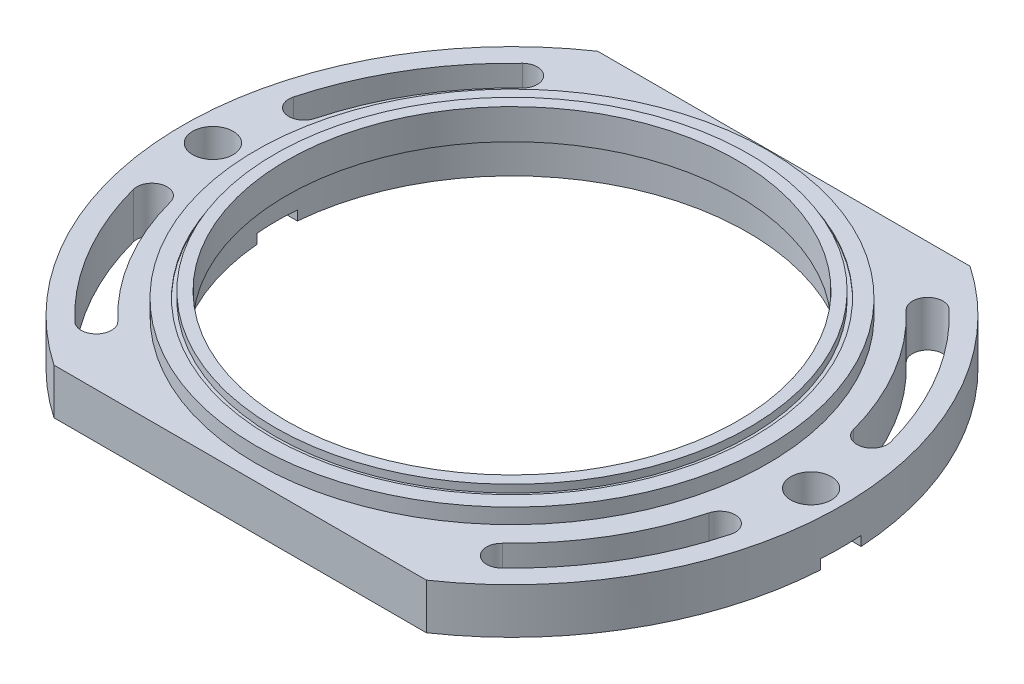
ISO-10303-21;
HEADER;
FILE_DESCRIPTION(('STEP AP214'),'2;1');
FILE_NAME('part.step','',(''),(''),'','','');
FILE_SCHEMA(('AUTOMOTIVE_DESIGN { 1 0 10303 214 1 1 1 1 }'));
ENDSEC;
DATA;
#1=APPLICATION_CONTEXT('core data for automotive mechanical design processes');
#2=APPLICATION_PROTOCOL_DEFINITION('international standard','automotive_design',2000,#1);
#3=PRODUCT_CONTEXT('',#1,'mechanical');
#4=PRODUCT('Part','Part','',(#3));
#5=PRODUCT_RELATED_PRODUCT_CATEGORY('part','',(#4));
#6=PRODUCT_DEFINITION_FORMATION('','',#4);
#7=PRODUCT_DEFINITION_CONTEXT('part definition',#1,'design');
#8=PRODUCT_DEFINITION('design','',#6,#7);
#9=PRODUCT_DEFINITION_SHAPE('','',#8);
#10=(LENGTH_UNIT() NAMED_UNIT(*) SI_UNIT(.MILLI.,.METRE.));
#11=(NAMED_UNIT(*) PLANE_ANGLE_UNIT() SI_UNIT($,.RADIAN.));
#12=(NAMED_UNIT(*) SI_UNIT($,.STERADIAN.) SOLID_ANGLE_UNIT());
#13=UNCERTAINTY_MEASURE_WITH_UNIT(LENGTH_MEASURE(1.E-05),#10,'distance_accuracy_value','');
#14=(GEOMETRIC_REPRESENTATION_CONTEXT(3) GLOBAL_UNCERTAINTY_ASSIGNED_CONTEXT((#13)) GLOBAL_UNIT_ASSIGNED_CONTEXT((#10,
#11,#12)) REPRESENTATION_CONTEXT('',''));
#15=CARTESIAN_POINT('',(0.,0.,0.));
#16=DIRECTION('',(0.,0.,1.));
#17=DIRECTION('',(1.,0.,0.));
#18=AXIS2_PLACEMENT_3D('',#15,#16,#17);
#19=CARTESIAN_POINT('',(-140.,3.8,8.));
#20=DIRECTION('',(0.,1.,0.));
#21=DIRECTION('',(0.,0.,1.));
#22=AXIS2_PLACEMENT_3D('',#19,#20,#21);
#23=PLANE('',#22);
#24=CARTESIAN_POINT('',(-101.,3.79999999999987,0.));
#25=DIRECTION('',(0.,-1.,0.));
#26=DIRECTION('',(0.,0.,-1.));
#27=AXIS2_PLACEMENT_3D('',#24,#25,#26);
#28=CIRCLE('',#27,4.);
#29=CARTESIAN_POINT('',(-101.,3.79999999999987,-3.99999999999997));
#30=VERTEX_POINT('',#29);
#31=EDGE_CURVE('E573',#30,#30,#28,.T.);
#32=ORIENTED_EDGE('',*,*,#31,.F.);
#33=EDGE_LOOP('',(#32));
#34=FACE_BOUND('',#33,.T.);
#35=CARTESIAN_POINT('',(-118.,3.8,0.));
#36=DIRECTION('',(0.,-1.,0.));
#37=DIRECTION('',(0.,0.,-1.));
#38=AXIS2_PLACEMENT_3D('',#35,#36,#37);
#39=CIRCLE('',#38,7.99999999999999);
#40=CARTESIAN_POINT('',(-118.,3.8,-8.));
#41=VERTEX_POINT('',#40);
#42=CARTESIAN_POINT('',(-118.,3.8,8.));
#43=VERTEX_POINT('',#42);
#44=EDGE_CURVE('E370',#41,#43,#39,.T.);
#45=ORIENTED_EDGE('',*,*,#44,.F.);
#46=DIRECTION('',(1.,0.,0.));
#47=VECTOR('',#46,1.);
#48=CARTESIAN_POINT('',(-140.,3.8,-8.));
#49=LINE('',#48,#47);
#50=CARTESIAN_POINT('',(-92.655275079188,3.8,-8.));
#51=VERTEX_POINT('',#50);
#52=EDGE_CURVE('E602',#41,#51,#49,.T.);
#53=ORIENTED_EDGE('',*,*,#52,.T.);
#54=CARTESIAN_POINT('',(0.,3.8,0.));
#55=DIRECTION('',(0.,1.,0.));
#56=DIRECTION('',(0.,0.,1.));
#57=AXIS2_PLACEMENT_3D('',#54,#55,#56);
#58=CIRCLE('',#57,93.);
#59=CARTESIAN_POINT('',(-92.655275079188,3.8,8.));
#60=VERTEX_POINT('',#59);
#61=EDGE_CURVE('E364',#51,#60,#58,.T.);
#62=ORIENTED_EDGE('',*,*,#61,.T.);
#63=DIRECTION('',(1.,0.,0.));
#64=VECTOR('',#63,1.);
#65=CARTESIAN_POINT('',(-140.,3.8,8.));
#66=LINE('',#65,#64);
#67=EDGE_CURVE('E596',#43,#60,#66,.T.);
#68=ORIENTED_EDGE('',*,*,#67,.F.);
#69=EDGE_LOOP('',(#45,#53,#62,#68));
#70=FACE_BOUND('',#69,.T.);
#71=ADVANCED_FACE('F356',(#34,#70),#23,.F.);
#72=EDGE_CURVE('E582',#43,#41,#39,.T.);
#73=ORIENTED_EDGE('',*,*,#72,.F.);
#74=CARTESIAN_POINT('',(-129.753612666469,3.8,8.));
#75=VERTEX_POINT('',#74);
#76=EDGE_CURVE('E598',#75,#43,#66,.T.);
#77=ORIENTED_EDGE('',*,*,#76,.F.);
#78=CARTESIAN_POINT('',(0.,3.8,0.));
#79=DIRECTION('',(0.,1.,0.));
#80=DIRECTION('',(0.,0.,1.));
#81=AXIS2_PLACEMENT_3D('',#78,#79,#80);
#82=CIRCLE('',#81,130.);
#83=CARTESIAN_POINT('',(-129.753612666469,3.8,-8.));
#84=VERTEX_POINT('',#83);
#85=EDGE_CURVE('E615',#75,#84,#82,.F.);
#86=ORIENTED_EDGE('',*,*,#85,.T.);
#87=EDGE_CURVE('E603',#84,#41,#49,.T.);
#88=ORIENTED_EDGE('',*,*,#87,.T.);
#89=EDGE_LOOP('',(#73,#77,#86,#88));
#90=FACE_BOUND('',#89,.T.);
#91=ADVANCED_FACE('F920',(#90),#23,.F.);
#92=CARTESIAN_POINT('',(118.,3.8,0.));
#93=DIRECTION('',(0.,-1.,0.));
#94=DIRECTION('',(0.,0.,-1.));
#95=AXIS2_PLACEMENT_3D('',#92,#93,#94);
#96=CIRCLE('',#95,7.99999999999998);
#97=CARTESIAN_POINT('',(118.,3.8,-8.));
#98=VERTEX_POINT('',#97);
#99=CARTESIAN_POINT('',(118.,3.8,8.));
#100=VERTEX_POINT('',#99);
#101=EDGE_CURVE('E377',#98,#100,#96,.T.);
#102=ORIENTED_EDGE('',*,*,#101,.F.);
#103=CARTESIAN_POINT('',(129.753612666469,3.8,-8.));
#104=VERTEX_POINT('',#103);
#105=EDGE_CURVE('E592',#98,#104,#49,.T.);
#106=ORIENTED_EDGE('',*,*,#105,.T.);
#107=CARTESIAN_POINT('',(0.,3.8,0.));
#108=DIRECTION('',(0.,1.,0.));
#109=DIRECTION('',(0.,0.,1.));
#110=AXIS2_PLACEMENT_3D('',#107,#108,#109);
#111=CIRCLE('',#110,130.);
#112=CARTESIAN_POINT('',(129.753612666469,3.8,8.));
#113=VERTEX_POINT('',#112);
#114=EDGE_CURVE('E612',#104,#113,#111,.F.);
#115=ORIENTED_EDGE('',*,*,#114,.T.);
#116=EDGE_CURVE('E597',#100,#113,#66,.T.);
#117=ORIENTED_EDGE('',*,*,#116,.F.);
#118=EDGE_LOOP('',(#102,#106,#115,#117));
#119=FACE_BOUND('',#118,.T.);
#120=ADVANCED_FACE('F900',(#119),#23,.F.);
#121=CARTESIAN_POINT('',(101.,3.79999999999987,0.));
#122=DIRECTION('',(0.,-1.,0.));
#123=DIRECTION('',(0.,0.,-1.));
#124=AXIS2_PLACEMENT_3D('',#121,#122,#123);
#125=CIRCLE('',#124,4.);
#126=CARTESIAN_POINT('',(101.,3.79999999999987,-4.));
#127=VERTEX_POINT('',#126);
#128=EDGE_CURVE('E566',#127,#127,#125,.T.);
#129=ORIENTED_EDGE('',*,*,#128,.F.);
#130=EDGE_LOOP('',(#129));
#131=FACE_BOUND('',#130,.T.);
#132=EDGE_CURVE('E587',#100,#98,#96,.T.);
#133=ORIENTED_EDGE('',*,*,#132,.F.);
#134=CARTESIAN_POINT('',(92.655275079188,3.8,8.));
#135=VERTEX_POINT('',#134);
#136=EDGE_CURVE('E593',#135,#100,#66,.T.);
#137=ORIENTED_EDGE('',*,*,#136,.F.);
#138=CARTESIAN_POINT('',(92.655275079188,3.8,-8.));
#139=VERTEX_POINT('',#138);
#140=EDGE_CURVE('E831',#135,#139,#58,.T.);
#141=ORIENTED_EDGE('',*,*,#140,.T.);
#142=EDGE_CURVE('E599',#139,#98,#49,.T.);
#143=ORIENTED_EDGE('',*,*,#142,.T.);
#144=EDGE_LOOP('',(#133,#137,#141,#143));
#145=FACE_BOUND('',#144,.T.);
#146=ADVANCED_FACE('F897',(#131,#145),#23,.F.);
#147=CARTESIAN_POINT('',(-93.,0.,0.));
#148=DIRECTION('',(0.,-1.,0.));
#149=DIRECTION('',(0.,0.,-1.));
#150=AXIS2_PLACEMENT_3D('',#147,#148,#149);
#151=PLANE('',#150);
#152=DIRECTION('',(-1.,0.,0.));
#153=VECTOR('',#152,1.);
#154=CARTESIAN_POINT('',(-93.,0.,8.));
#155=LINE('',#154,#153);
#156=CARTESIAN_POINT('',(129.753612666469,0.,8.));
#157=VERTEX_POINT('',#156);
#158=CARTESIAN_POINT('',(92.655275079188,0.,8.));
#159=VERTEX_POINT('',#158);
#160=EDGE_CURVE('E620',#157,#159,#155,.T.);
#161=ORIENTED_EDGE('',*,*,#160,.F.);
#162=CARTESIAN_POINT('',(0.,0.,0.));
#163=DIRECTION('',(0.,1.,0.));
#164=DIRECTION('',(0.,0.,1.));
#165=AXIS2_PLACEMENT_3D('',#162,#163,#164);
#166=CIRCLE('',#165,130.);
#167=CARTESIAN_POINT('',(73.4672546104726,0.,107.25));
#168=VERTEX_POINT('',#167);
#169=EDGE_CURVE('E741',#168,#157,#166,.T.);
#170=ORIENTED_EDGE('',*,*,#169,.F.);
#171=DIRECTION('',(-1.,0.,0.));
#172=VECTOR('',#171,1.);
#173=CARTESIAN_POINT('',(-93.,0.,107.25));
#174=LINE('',#173,#172);
#175=CARTESIAN_POINT('',(-73.4672546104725,0.,107.25));
#176=VERTEX_POINT('',#175);
#177=EDGE_CURVE('E775',#168,#176,#174,.T.);
#178=ORIENTED_EDGE('',*,*,#177,.T.);
#179=CARTESIAN_POINT('',(-129.753612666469,0.,8.));
#180=VERTEX_POINT('',#179);
#181=EDGE_CURVE('E746',#180,#176,#166,.T.);
#182=ORIENTED_EDGE('',*,*,#181,.F.);
#183=CARTESIAN_POINT('',(-92.655275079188,0.,8.));
#184=VERTEX_POINT('',#183);
#185=EDGE_CURVE('E617',#184,#180,#155,.T.);
#186=ORIENTED_EDGE('',*,*,#185,.F.);
#187=CARTESIAN_POINT('',(0.,0.,0.));
#188=DIRECTION('',(0.,1.,0.));
#189=DIRECTION('',(0.,0.,1.));
#190=AXIS2_PLACEMENT_3D('',#187,#188,#189);
#191=CIRCLE('',#190,93.);
#192=EDGE_CURVE('E737',#184,#159,#191,.T.);
#193=ORIENTED_EDGE('',*,*,#192,.T.);
#194=EDGE_LOOP('',(#161,#170,#178,#182,#186,#193));
#195=FACE_BOUND('',#194,.T.);
#196=CARTESIAN_POINT('',(80.,0.,84.));
#197=DIRECTION('',(0.,-1.,0.));
#198=DIRECTION('',(0.,0.,-1.));
#199=AXIS2_PLACEMENT_3D('',#196,#197,#198);
#200=CIRCLE('',#199,6.00000000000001);
#201=CARTESIAN_POINT('',(75.8620689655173,0.,79.6551724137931));
#202=VERTEX_POINT('',#201);
#203=CARTESIAN_POINT('',(84.1379310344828,0.,88.3448275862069));
#204=VERTEX_POINT('',#203);
#205=EDGE_CURVE('E817',#202,#204,#200,.F.);
#206=ORIENTED_EDGE('',*,*,#205,.T.);
#207=CARTESIAN_POINT('',(0.,0.,0.));
#208=DIRECTION('',(0.,-1.,0.));
#209=DIRECTION('',(0.,0.,-1.));
#210=AXIS2_PLACEMENT_3D('',#207,#208,#209);
#211=CIRCLE('',#210,122.);
#212=CARTESIAN_POINT('',(117.849432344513,0.,31.551724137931));
#213=VERTEX_POINT('',#212);
#214=EDGE_CURVE('E826',#204,#213,#211,.F.);
#215=ORIENTED_EDGE('',*,*,#214,.T.);
#216=CARTESIAN_POINT('',(112.053558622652,0.,30.));
#217=DIRECTION('',(0.,-1.,0.));
#218=DIRECTION('',(0.,0.,-1.));
#219=AXIS2_PLACEMENT_3D('',#216,#217,#218);
#220=CIRCLE('',#219,6.);
#221=CARTESIAN_POINT('',(106.25768490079,0.,28.448275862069));
#222=VERTEX_POINT('',#221);
#223=EDGE_CURVE('E823',#213,#222,#220,.F.);
#224=ORIENTED_EDGE('',*,*,#223,.T.);
#225=CARTESIAN_POINT('',(0.,0.,0.));
#226=DIRECTION('',(0.,-1.,0.));
#227=DIRECTION('',(0.,0.,-1.));
#228=AXIS2_PLACEMENT_3D('',#225,#226,#227);
#229=CIRCLE('',#228,110.);
#230=EDGE_CURVE('E820',#222,#202,#229,.T.);
#231=ORIENTED_EDGE('',*,*,#230,.T.);
#232=EDGE_LOOP('',(#206,#215,#224,#231));
#233=FACE_BOUND('',#232,.T.);
#234=CARTESIAN_POINT('',(-80.,0.,84.));
#235=DIRECTION('',(0.,-1.,0.));
#236=DIRECTION('',(0.,0.,-1.));
#237=AXIS2_PLACEMENT_3D('',#234,#235,#236);
#238=CIRCLE('',#237,6.00000000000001);
#239=CARTESIAN_POINT('',(-84.1379310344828,0.,88.3448275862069));
#240=VERTEX_POINT('',#239);
#241=CARTESIAN_POINT('',(-75.8620689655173,0.,79.6551724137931));
#242=VERTEX_POINT('',#241);
#243=EDGE_CURVE('E805',#240,#242,#238,.F.);
#244=ORIENTED_EDGE('',*,*,#243,.T.);
#245=CARTESIAN_POINT('',(0.,0.,0.));
#246=DIRECTION('',(0.,-1.,0.));
#247=DIRECTION('',(0.,0.,-1.));
#248=AXIS2_PLACEMENT_3D('',#245,#246,#247);
#249=CIRCLE('',#248,110.);
#250=CARTESIAN_POINT('',(-106.25768490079,0.,28.448275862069));
#251=VERTEX_POINT('',#250);
#252=EDGE_CURVE('E814',#242,#251,#249,.T.);
#253=ORIENTED_EDGE('',*,*,#252,.T.);
#254=CARTESIAN_POINT('',(-112.053558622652,0.,30.));
#255=DIRECTION('',(0.,-1.,0.));
#256=DIRECTION('',(0.,0.,-1.));
#257=AXIS2_PLACEMENT_3D('',#254,#255,#256);
#258=CIRCLE('',#257,6.);
#259=CARTESIAN_POINT('',(-117.849432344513,0.,31.551724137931));
#260=VERTEX_POINT('',#259);
#261=EDGE_CURVE('E811',#251,#260,#258,.F.);
#262=ORIENTED_EDGE('',*,*,#261,.T.);
#263=CARTESIAN_POINT('',(0.,0.,0.));
#264=DIRECTION('',(0.,-1.,0.));
#265=DIRECTION('',(0.,0.,-1.));
#266=AXIS2_PLACEMENT_3D('',#263,#264,#265);
#267=CIRCLE('',#266,122.);
#268=EDGE_CURVE('E808',#260,#240,#267,.F.);
#269=ORIENTED_EDGE('',*,*,#268,.T.);
#270=EDGE_LOOP('',(#244,#253,#262,#269));
#271=FACE_BOUND('',#270,.T.);
#272=ADVANCED_FACE('F858',(#195,#233,#271),#151,.T.);
#273=CARTESIAN_POINT('',(-101.,18.,0.));
#274=DIRECTION('',(0.,1.,0.));
#275=DIRECTION('',(0.,0.,1.));
#276=AXIS2_PLACEMENT_3D('',#273,#274,#275);
#277=PLANE('',#276);
#278=CARTESIAN_POINT('',(-118.,18.,0.));
#279=DIRECTION('',(0.,1.,0.));
#280=DIRECTION('',(0.,0.,1.));
#281=AXIS2_PLACEMENT_3D('',#278,#279,#280);
#282=CIRCLE('',#281,7.99999999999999);
#283=CARTESIAN_POINT('',(-118.,18.,7.99999999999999));
#284=VERTEX_POINT('',#283);
#285=EDGE_CURVE('E584',#284,#284,#282,.T.);
#286=ORIENTED_EDGE('',*,*,#285,.F.);
#287=EDGE_LOOP('',(#286));
#288=FACE_BOUND('',#287,.T.);
#289=CARTESIAN_POINT('',(118.,18.,0.));
#290=DIRECTION('',(0.,1.,0.));
#291=DIRECTION('',(0.,0.,1.));
#292=AXIS2_PLACEMENT_3D('',#289,#290,#291);
#293=CIRCLE('',#292,7.99999999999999);
#294=CARTESIAN_POINT('',(118.,18.,7.99999999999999));
#295=VERTEX_POINT('',#294);
#296=EDGE_CURVE('E589',#295,#295,#293,.T.);
#297=ORIENTED_EDGE('',*,*,#296,.F.);
#298=EDGE_LOOP('',(#297));
#299=FACE_BOUND('',#298,.T.);
#300=CARTESIAN_POINT('',(-112.053558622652,18.,30.));
#301=DIRECTION('',(0.,1.,0.));
#302=DIRECTION('',(0.,0.,1.));
#303=AXIS2_PLACEMENT_3D('',#300,#301,#302);
#304=CIRCLE('',#303,6.);
#305=CARTESIAN_POINT('',(-117.849432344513,18.,31.551724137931));
#306=VERTEX_POINT('',#305);
#307=CARTESIAN_POINT('',(-106.25768490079,18.,28.448275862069));
#308=VERTEX_POINT('',#307);
#309=EDGE_CURVE('E664',#306,#308,#304,.F.);
#310=ORIENTED_EDGE('',*,*,#309,.T.);
#311=CARTESIAN_POINT('',(0.,18.,0.));
#312=DIRECTION('',(0.,1.,0.));
#313=DIRECTION('',(0.,0.,1.));
#314=AXIS2_PLACEMENT_3D('',#311,#312,#313);
#315=CIRCLE('',#314,110.);
#316=CARTESIAN_POINT('',(-75.8620689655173,18.,79.6551724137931));
#317=VERTEX_POINT('',#316);
#318=EDGE_CURVE('E667',#308,#317,#315,.T.);
#319=ORIENTED_EDGE('',*,*,#318,.T.);
#320=CARTESIAN_POINT('',(-80.,18.,84.));
#321=DIRECTION('',(0.,1.,0.));
#322=DIRECTION('',(0.,0.,1.));
#323=AXIS2_PLACEMENT_3D('',#320,#321,#322);
#324=CIRCLE('',#323,6.00000000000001);
#325=CARTESIAN_POINT('',(-84.1379310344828,18.,88.3448275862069));
#326=VERTEX_POINT('',#325);
#327=EDGE_CURVE('E658',#317,#326,#324,.F.);
#328=ORIENTED_EDGE('',*,*,#327,.T.);
#329=CARTESIAN_POINT('',(0.,18.,0.));
#330=DIRECTION('',(0.,1.,0.));
#331=DIRECTION('',(0.,0.,1.));
#332=AXIS2_PLACEMENT_3D('',#329,#330,#331);
#333=CIRCLE('',#332,122.);
#334=EDGE_CURVE('E661',#326,#306,#333,.F.);
#335=ORIENTED_EDGE('',*,*,#334,.T.);
#336=EDGE_LOOP('',(#310,#319,#328,#335));
#337=FACE_BOUND('',#336,.T.);
#338=CARTESIAN_POINT('',(80.,18.,-84.));
#339=DIRECTION('',(0.,1.,0.));
#340=DIRECTION('',(0.,0.,1.));
#341=AXIS2_PLACEMENT_3D('',#338,#339,#340);
#342=CIRCLE('',#341,6.00000000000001);
#343=CARTESIAN_POINT('',(75.8620689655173,18.,-79.6551724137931));
#344=VERTEX_POINT('',#343);
#345=CARTESIAN_POINT('',(84.1379310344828,18.,-88.3448275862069));
#346=VERTEX_POINT('',#345);
#347=EDGE_CURVE('E710',#344,#346,#342,.F.);
#348=ORIENTED_EDGE('',*,*,#347,.T.);
#349=CARTESIAN_POINT('',(0.,18.,0.));
#350=DIRECTION('',(0.,1.,0.));
#351=DIRECTION('',(0.,0.,1.));
#352=AXIS2_PLACEMENT_3D('',#349,#350,#351);
#353=CIRCLE('',#352,122.);
#354=CARTESIAN_POINT('',(117.849432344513,18.,-31.551724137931));
#355=VERTEX_POINT('',#354);
#356=EDGE_CURVE('E713',#346,#355,#353,.F.);
#357=ORIENTED_EDGE('',*,*,#356,.T.);
#358=CARTESIAN_POINT('',(112.053558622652,18.,-30.));
#359=DIRECTION('',(0.,1.,0.));
#360=DIRECTION('',(0.,0.,1.));
#361=AXIS2_PLACEMENT_3D('',#358,#359,#360);
#362=CIRCLE('',#361,6.);
#363=CARTESIAN_POINT('',(106.25768490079,18.,-28.448275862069));
#364=VERTEX_POINT('',#363);
#365=EDGE_CURVE('E704',#355,#364,#362,.F.);
#366=ORIENTED_EDGE('',*,*,#365,.T.);
#367=CARTESIAN_POINT('',(0.,18.,0.));
#368=DIRECTION('',(0.,1.,0.));
#369=DIRECTION('',(0.,0.,1.));
#370=AXIS2_PLACEMENT_3D('',#367,#368,#369);
#371=CIRCLE('',#370,110.);
#372=EDGE_CURVE('E707',#364,#344,#371,.T.);
#373=ORIENTED_EDGE('',*,*,#372,.T.);
#374=EDGE_LOOP('',(#348,#357,#366,#373));
#375=FACE_BOUND('',#374,.T.);
#376=CARTESIAN_POINT('',(0.,18.,0.));
#377=DIRECTION('',(0.,1.,0.));
#378=DIRECTION('',(0.,0.,1.));
#379=AXIS2_PLACEMENT_3D('',#376,#377,#378);
#380=CIRCLE('',#379,101.);
#381=CARTESIAN_POINT('',(0.,18.,101.));
#382=VERTEX_POINT('',#381);
#383=EDGE_CURVE('E751',#382,#382,#380,.T.);
#384=ORIENTED_EDGE('',*,*,#383,.F.);
#385=EDGE_LOOP('',(#384));
#386=FACE_BOUND('',#385,.T.);
#387=CARTESIAN_POINT('',(0.,18.,0.));
#388=DIRECTION('',(0.,1.,0.));
#389=DIRECTION('',(0.,0.,1.));
#390=AXIS2_PLACEMENT_3D('',#387,#388,#389);
#391=CIRCLE('',#390,130.);
#392=CARTESIAN_POINT('',(73.4672546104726,18.,107.25));
#393=VERTEX_POINT('',#392);
#394=CARTESIAN_POINT('',(73.4672546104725,18.,-107.25));
#395=VERTEX_POINT('',#394);
#396=EDGE_CURVE('E748',#393,#395,#391,.T.);
#397=ORIENTED_EDGE('',*,*,#396,.T.);
#398=DIRECTION('',(-1.,0.,0.));
#399=VECTOR('',#398,1.);
#400=CARTESIAN_POINT('',(-101.,18.,-107.25));
#401=LINE('',#400,#399);
#402=CARTESIAN_POINT('',(-73.4672546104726,18.,-107.25));
#403=VERTEX_POINT('',#402);
#404=EDGE_CURVE('E722',#395,#403,#401,.T.);
#405=ORIENTED_EDGE('',*,*,#404,.T.);
#406=CARTESIAN_POINT('',(-73.4672546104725,18.,107.25));
#407=VERTEX_POINT('',#406);
#408=EDGE_CURVE('E744',#403,#407,#391,.T.);
#409=ORIENTED_EDGE('',*,*,#408,.T.);
#410=DIRECTION('',(1.,0.,0.));
#411=VECTOR('',#410,1.);
#412=CARTESIAN_POINT('',(-101.,18.,107.25));
#413=LINE('',#412,#411);
#414=EDGE_CURVE('E731',#407,#393,#413,.T.);
#415=ORIENTED_EDGE('',*,*,#414,.T.);
#416=EDGE_LOOP('',(#397,#405,#409,#415));
#417=FACE_BOUND('',#416,.T.);
#418=CARTESIAN_POINT('',(-80.,18.,-84.));
#419=DIRECTION('',(0.,1.,0.));
#420=DIRECTION('',(0.,0.,1.));
#421=AXIS2_PLACEMENT_3D('',#418,#419,#420);
#422=CIRCLE('',#421,6.00000000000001);
#423=CARTESIAN_POINT('',(-84.1379310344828,18.,-88.3448275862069));
#424=VERTEX_POINT('',#423);
#425=CARTESIAN_POINT('',(-75.8620689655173,18.,-79.6551724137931));
#426=VERTEX_POINT('',#425);
#427=EDGE_CURVE('E687',#424,#426,#422,.F.);
#428=ORIENTED_EDGE('',*,*,#427,.T.);
#429=CARTESIAN_POINT('',(0.,18.,0.));
#430=DIRECTION('',(0.,1.,0.));
#431=DIRECTION('',(0.,0.,1.));
#432=AXIS2_PLACEMENT_3D('',#429,#430,#431);
#433=CIRCLE('',#432,110.);
#434=CARTESIAN_POINT('',(-106.25768490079,18.,-28.448275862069));
#435=VERTEX_POINT('',#434);
#436=EDGE_CURVE('E690',#426,#435,#433,.T.);
#437=ORIENTED_EDGE('',*,*,#436,.T.);
#438=CARTESIAN_POINT('',(-112.053558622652,18.,-30.));
#439=DIRECTION('',(0.,1.,0.));
#440=DIRECTION('',(0.,0.,1.));
#441=AXIS2_PLACEMENT_3D('',#438,#439,#440);
#442=CIRCLE('',#441,6.);
#443=CARTESIAN_POINT('',(-117.849432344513,18.,-31.551724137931));
#444=VERTEX_POINT('',#443);
#445=EDGE_CURVE('E681',#435,#444,#442,.F.);
#446=ORIENTED_EDGE('',*,*,#445,.T.);
#447=CARTESIAN_POINT('',(0.,18.,0.));
#448=DIRECTION('',(0.,1.,0.));
#449=DIRECTION('',(0.,0.,1.));
#450=AXIS2_PLACEMENT_3D('',#447,#448,#449);
#451=CIRCLE('',#450,122.);
#452=EDGE_CURVE('E684',#444,#424,#451,.F.);
#453=ORIENTED_EDGE('',*,*,#452,.T.);
#454=EDGE_LOOP('',(#428,#437,#446,#453));
#455=FACE_BOUND('',#454,.T.);
#456=CARTESIAN_POINT('',(112.053558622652,18.,30.));
#457=DIRECTION('',(0.,1.,0.));
#458=DIRECTION('',(0.,0.,1.));
#459=AXIS2_PLACEMENT_3D('',#456,#457,#458);
#460=CIRCLE('',#459,6.);
#461=CARTESIAN_POINT('',(106.25768490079,18.,28.448275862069));
#462=VERTEX_POINT('',#461);
#463=CARTESIAN_POINT('',(117.849432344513,18.,31.551724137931));
#464=VERTEX_POINT('',#463);
#465=EDGE_CURVE('E641',#462,#464,#460,.F.);
#466=ORIENTED_EDGE('',*,*,#465,.T.);
#467=CARTESIAN_POINT('',(0.,18.,0.));
#468=DIRECTION('',(0.,1.,0.));
#469=DIRECTION('',(0.,0.,1.));
#470=AXIS2_PLACEMENT_3D('',#467,#468,#469);
#471=CIRCLE('',#470,122.);
#472=CARTESIAN_POINT('',(84.1379310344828,18.,88.3448275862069));
#473=VERTEX_POINT('',#472);
#474=EDGE_CURVE('E644',#464,#473,#471,.F.);
#475=ORIENTED_EDGE('',*,*,#474,.T.);
#476=CARTESIAN_POINT('',(80.,18.,84.));
#477=DIRECTION('',(0.,1.,0.));
#478=DIRECTION('',(0.,0.,1.));
#479=AXIS2_PLACEMENT_3D('',#476,#477,#478);
#480=CIRCLE('',#479,6.00000000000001);
#481=CARTESIAN_POINT('',(75.8620689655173,18.,79.6551724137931));
#482=VERTEX_POINT('',#481);
#483=EDGE_CURVE('E635',#473,#482,#480,.F.);
#484=ORIENTED_EDGE('',*,*,#483,.T.);
#485=CARTESIAN_POINT('',(0.,18.,0.));
#486=DIRECTION('',(0.,1.,0.));
#487=DIRECTION('',(0.,0.,1.));
#488=AXIS2_PLACEMENT_3D('',#485,#486,#487);
#489=CIRCLE('',#488,110.);
#490=EDGE_CURVE('E638',#482,#462,#489,.T.);
#491=ORIENTED_EDGE('',*,*,#490,.T.);
#492=EDGE_LOOP('',(#466,#475,#484,#491));
#493=FACE_BOUND('',#492,.T.);
#494=ADVANCED_FACE('F886',(#288,#299,#337,#375,#386,#417,#455,#493),#277,.T.);
#495=DIRECTION('',(1.,0.,0.));
#496=VECTOR('',#495,1.);
#497=CARTESIAN_POINT('',(-93.,0.,-8.));
#498=LINE('',#497,#496);
#499=CARTESIAN_POINT('',(-129.753612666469,0.,-8.));
#500=VERTEX_POINT('',#499);
#501=CARTESIAN_POINT('',(-92.655275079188,0.,-8.));
#502=VERTEX_POINT('',#501);
#503=EDGE_CURVE('E607',#500,#502,#498,.T.);
#504=ORIENTED_EDGE('',*,*,#503,.F.);
#505=CARTESIAN_POINT('',(-73.4672546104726,0.,-107.25));
#506=VERTEX_POINT('',#505);
#507=EDGE_CURVE('E747',#506,#500,#166,.T.);
#508=ORIENTED_EDGE('',*,*,#507,.F.);
#509=DIRECTION('',(1.,0.,0.));
#510=VECTOR('',#509,1.);
#511=CARTESIAN_POINT('',(-93.,0.,-107.25));
#512=LINE('',#511,#510);
#513=CARTESIAN_POINT('',(73.4672546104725,0.,-107.25));
#514=VERTEX_POINT('',#513);
#515=EDGE_CURVE('E778',#506,#514,#512,.T.);
#516=ORIENTED_EDGE('',*,*,#515,.T.);
#517=CARTESIAN_POINT('',(129.753612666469,0.,-8.));
#518=VERTEX_POINT('',#517);
#519=EDGE_CURVE('E745',#518,#514,#166,.T.);
#520=ORIENTED_EDGE('',*,*,#519,.F.);
#521=CARTESIAN_POINT('',(92.655275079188,0.,-8.));
#522=VERTEX_POINT('',#521);
#523=EDGE_CURVE('E604',#522,#518,#498,.T.);
#524=ORIENTED_EDGE('',*,*,#523,.F.);
#525=EDGE_CURVE('E740',#522,#502,#191,.T.);
#526=ORIENTED_EDGE('',*,*,#525,.T.);
#527=EDGE_LOOP('',(#504,#508,#516,#520,#524,#526));
#528=FACE_BOUND('',#527,.T.);
#529=CARTESIAN_POINT('',(112.053558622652,0.,-30.));
#530=DIRECTION('',(0.,-1.,0.));
#531=DIRECTION('',(0.,0.,-1.));
#532=AXIS2_PLACEMENT_3D('',#529,#530,#531);
#533=CIRCLE('',#532,6.);
#534=CARTESIAN_POINT('',(106.25768490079,0.,-28.448275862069));
#535=VERTEX_POINT('',#534);
#536=CARTESIAN_POINT('',(117.849432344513,0.,-31.551724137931));
#537=VERTEX_POINT('',#536);
#538=EDGE_CURVE('E781',#535,#537,#533,.F.);
#539=ORIENTED_EDGE('',*,*,#538,.T.);
#540=CARTESIAN_POINT('',(0.,0.,0.));
#541=DIRECTION('',(0.,-1.,0.));
#542=DIRECTION('',(0.,0.,-1.));
#543=AXIS2_PLACEMENT_3D('',#540,#541,#542);
#544=CIRCLE('',#543,122.);
#545=CARTESIAN_POINT('',(84.1379310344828,0.,-88.3448275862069));
#546=VERTEX_POINT('',#545);
#547=EDGE_CURVE('E790',#537,#546,#544,.F.);
#548=ORIENTED_EDGE('',*,*,#547,.T.);
#549=CARTESIAN_POINT('',(80.,0.,-84.));
#550=DIRECTION('',(0.,-1.,0.));
#551=DIRECTION('',(0.,0.,-1.));
#552=AXIS2_PLACEMENT_3D('',#549,#550,#551);
#553=CIRCLE('',#552,6.00000000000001);
#554=CARTESIAN_POINT('',(75.8620689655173,0.,-79.6551724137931));
#555=VERTEX_POINT('',#554);
#556=EDGE_CURVE('E787',#546,#555,#553,.F.);
#557=ORIENTED_EDGE('',*,*,#556,.T.);
#558=CARTESIAN_POINT('',(0.,0.,0.));
#559=DIRECTION('',(0.,-1.,0.));
#560=DIRECTION('',(0.,0.,-1.));
#561=AXIS2_PLACEMENT_3D('',#558,#559,#560);
#562=CIRCLE('',#561,110.);
#563=EDGE_CURVE('E784',#555,#535,#562,.T.);
#564=ORIENTED_EDGE('',*,*,#563,.T.);
#565=EDGE_LOOP('',(#539,#548,#557,#564));
#566=FACE_BOUND('',#565,.T.);
#567=CARTESIAN_POINT('',(-112.053558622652,0.,-30.));
#568=DIRECTION('',(0.,-1.,0.));
#569=DIRECTION('',(0.,0.,-1.));
#570=AXIS2_PLACEMENT_3D('',#567,#568,#569);
#571=CIRCLE('',#570,6.);
#572=CARTESIAN_POINT('',(-117.849432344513,0.,-31.551724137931));
#573=VERTEX_POINT('',#572);
#574=CARTESIAN_POINT('',(-106.25768490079,0.,-28.448275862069));
#575=VERTEX_POINT('',#574);
#576=EDGE_CURVE('E793',#573,#575,#571,.F.);
#577=ORIENTED_EDGE('',*,*,#576,.T.);
#578=CARTESIAN_POINT('',(0.,0.,0.));
#579=DIRECTION('',(0.,-1.,0.));
#580=DIRECTION('',(0.,0.,-1.));
#581=AXIS2_PLACEMENT_3D('',#578,#579,#580);
#582=CIRCLE('',#581,110.);
#583=CARTESIAN_POINT('',(-75.8620689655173,0.,-79.6551724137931));
#584=VERTEX_POINT('',#583);
#585=EDGE_CURVE('E802',#575,#584,#582,.T.);
#586=ORIENTED_EDGE('',*,*,#585,.T.);
#587=CARTESIAN_POINT('',(-80.,0.,-84.));
#588=DIRECTION('',(0.,-1.,0.));
#589=DIRECTION('',(0.,0.,-1.));
#590=AXIS2_PLACEMENT_3D('',#587,#588,#589);
#591=CIRCLE('',#590,6.00000000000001);
#592=CARTESIAN_POINT('',(-84.1379310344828,0.,-88.3448275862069));
#593=VERTEX_POINT('',#592);
#594=EDGE_CURVE('E799',#584,#593,#591,.F.);
#595=ORIENTED_EDGE('',*,*,#594,.T.);
#596=CARTESIAN_POINT('',(0.,0.,0.));
#597=DIRECTION('',(0.,-1.,0.));
#598=DIRECTION('',(0.,0.,-1.));
#599=AXIS2_PLACEMENT_3D('',#596,#597,#598);
#600=CIRCLE('',#599,122.);
#601=EDGE_CURVE('E796',#593,#573,#600,.F.);
#602=ORIENTED_EDGE('',*,*,#601,.T.);
#603=EDGE_LOOP('',(#577,#586,#595,#602));
#604=FACE_BOUND('',#603,.T.);
#605=ADVANCED_FACE('F879',(#528,#566,#604),#151,.T.);
#606=CARTESIAN_POINT('',(0.,140.,0.));
#607=DIRECTION('',(0.,1.,0.));
#608=DIRECTION('',(0.,0.,1.));
#609=AXIS2_PLACEMENT_3D('',#606,#607,#608);
#610=CYLINDRICAL_SURFACE('',#609,130.);
#611=DIRECTION('',(0.,1.,0.));
#612=VECTOR('',#611,1.);
#613=CARTESIAN_POINT('',(-129.753612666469,140.,8.));
#614=LINE('',#613,#612);
#615=EDGE_CURVE('E619',#180,#75,#614,.T.);
#616=ORIENTED_EDGE('',*,*,#615,.F.);
#617=ORIENTED_EDGE('',*,*,#181,.T.);
#618=DIRECTION('',(0.,1.,0.));
#619=VECTOR('',#618,1.);
#620=CARTESIAN_POINT('',(-73.4672546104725,140.,107.25));
#621=LINE('',#620,#619);
#622=EDGE_CURVE('E725',#176,#407,#621,.T.);
#623=ORIENTED_EDGE('',*,*,#622,.T.);
#624=ORIENTED_EDGE('',*,*,#408,.F.);
#625=DIRECTION('',(0.,1.,0.));
#626=VECTOR('',#625,1.);
#627=CARTESIAN_POINT('',(-73.4672546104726,140.,-107.25));
#628=LINE('',#627,#626);
#629=EDGE_CURVE('E719',#403,#506,#628,.F.);
#630=ORIENTED_EDGE('',*,*,#629,.T.);
#631=ORIENTED_EDGE('',*,*,#507,.T.);
#632=DIRECTION('',(0.,1.,0.));
#633=VECTOR('',#632,1.);
#634=CARTESIAN_POINT('',(-129.753612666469,140.,-8.));
#635=LINE('',#634,#633);
#636=EDGE_CURVE('E610',#84,#500,#635,.F.);
#637=ORIENTED_EDGE('',*,*,#636,.F.);
#638=ORIENTED_EDGE('',*,*,#85,.F.);
#639=EDGE_LOOP('',(#616,#617,#623,#624,#630,#631,#637,#638));
#640=FACE_BOUND('',#639,.T.);
#641=ADVANCED_FACE('F882',(#640),#610,.T.);
#642=DIRECTION('',(0.,1.,0.));
#643=VECTOR('',#642,1.);
#644=CARTESIAN_POINT('',(129.753612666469,140.,8.));
#645=LINE('',#644,#643);
#646=EDGE_CURVE('E622',#113,#157,#645,.F.);
#647=ORIENTED_EDGE('',*,*,#646,.F.);
#648=ORIENTED_EDGE('',*,*,#114,.F.);
#649=DIRECTION('',(0.,1.,0.));
#650=VECTOR('',#649,1.);
#651=CARTESIAN_POINT('',(129.753612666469,140.,-8.));
#652=LINE('',#651,#650);
#653=EDGE_CURVE('E606',#518,#104,#652,.T.);
#654=ORIENTED_EDGE('',*,*,#653,.F.);
#655=ORIENTED_EDGE('',*,*,#519,.T.);
#656=DIRECTION('',(0.,1.,0.));
#657=VECTOR('',#656,1.);
#658=CARTESIAN_POINT('',(73.4672546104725,140.,-107.25));
#659=LINE('',#658,#657);
#660=EDGE_CURVE('E716',#514,#395,#659,.T.);
#661=ORIENTED_EDGE('',*,*,#660,.T.);
#662=ORIENTED_EDGE('',*,*,#396,.F.);
#663=DIRECTION('',(0.,1.,0.));
#664=VECTOR('',#663,1.);
#665=CARTESIAN_POINT('',(73.4672546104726,140.,107.25));
#666=LINE('',#665,#664);
#667=EDGE_CURVE('E728',#393,#168,#666,.F.);
#668=ORIENTED_EDGE('',*,*,#667,.T.);
#669=ORIENTED_EDGE('',*,*,#169,.T.);
#670=EDGE_LOOP('',(#647,#648,#654,#655,#661,#662,#668,#669));
#671=FACE_BOUND('',#670,.T.);
#672=ADVANCED_FACE('F870',(#671),#610,.T.);
#673=CARTESIAN_POINT('',(-93.,14.5,0.));
#674=DIRECTION('',(0.,-1.,0.));
#675=DIRECTION('',(0.,0.,-1.));
#676=AXIS2_PLACEMENT_3D('',#673,#674,#675);
#677=PLANE('',#676);
#678=CARTESIAN_POINT('',(0.,14.5,0.));
#679=DIRECTION('',(0.,1.,0.));
#680=DIRECTION('',(0.,0.,1.));
#681=AXIS2_PLACEMENT_3D('',#678,#679,#680);
#682=CIRCLE('',#681,89.);
#683=CARTESIAN_POINT('',(0.,14.5,89.));
#684=VERTEX_POINT('',#683);
#685=EDGE_CURVE('E772',#684,#684,#682,.T.);
#686=ORIENTED_EDGE('',*,*,#685,.T.);
#687=EDGE_LOOP('',(#686));
#688=FACE_BOUND('',#687,.T.);
#689=CARTESIAN_POINT('',(0.,14.5,0.));
#690=DIRECTION('',(0.,1.,0.));
#691=DIRECTION('',(0.,0.,1.));
#692=AXIS2_PLACEMENT_3D('',#689,#690,#691);
#693=CIRCLE('',#692,93.);
#694=CARTESIAN_POINT('',(0.,14.5,93.));
#695=VERTEX_POINT('',#694);
#696=EDGE_CURVE('E734',#695,#695,#693,.T.);
#697=ORIENTED_EDGE('',*,*,#696,.F.);
#698=EDGE_LOOP('',(#697));
#699=FACE_BOUND('',#698,.T.);
#700=ADVANCED_FACE('F358',(#688,#699),#677,.T.);
#701=CARTESIAN_POINT('',(0.,140.,0.));
#702=DIRECTION('',(0.,1.,0.));
#703=DIRECTION('',(0.,0.,1.));
#704=AXIS2_PLACEMENT_3D('',#701,#702,#703);
#705=CYLINDRICAL_SURFACE('',#704,89.);
#706=CARTESIAN_POINT('',(0.,26.5,0.));
#707=DIRECTION('',(0.,1.,0.));
#708=DIRECTION('',(0.,0.,1.));
#709=AXIS2_PLACEMENT_3D('',#706,#707,#708);
#710=CIRCLE('',#709,89.);
#711=CARTESIAN_POINT('',(0.,26.5,89.));
#712=VERTEX_POINT('',#711);
#713=EDGE_CURVE('E769',#712,#712,#710,.T.);
#714=ORIENTED_EDGE('',*,*,#713,.T.);
#715=EDGE_LOOP('',(#714));
#716=FACE_BOUND('',#715,.T.);
#717=ORIENTED_EDGE('',*,*,#685,.F.);
#718=EDGE_LOOP('',(#717));
#719=FACE_BOUND('',#718,.T.);
#720=ADVANCED_FACE('F1055',(#716,#719),#705,.F.);
#721=CARTESIAN_POINT('',(-89.,26.5,0.));
#722=DIRECTION('',(0.,1.,0.));
#723=DIRECTION('',(0.,0.,1.));
#724=AXIS2_PLACEMENT_3D('',#721,#722,#723);
#725=PLANE('',#724);
#726=CARTESIAN_POINT('',(0.,26.5,0.));
#727=DIRECTION('',(0.,1.,0.));
#728=DIRECTION('',(0.,0.,1.));
#729=AXIS2_PLACEMENT_3D('',#726,#727,#728);
#730=CIRCLE('',#729,93.5);
#731=CARTESIAN_POINT('',(0.,26.5,93.5));
#732=VERTEX_POINT('',#731);
#733=EDGE_CURVE('E766',#732,#732,#730,.T.);
#734=ORIENTED_EDGE('',*,*,#733,.T.);
#735=EDGE_LOOP('',(#734));
#736=FACE_BOUND('',#735,.T.);
#737=ORIENTED_EDGE('',*,*,#713,.F.);
#738=EDGE_LOOP('',(#737));
#739=FACE_BOUND('',#738,.T.);
#740=ADVANCED_FACE('F1060',(#736,#739),#725,.T.);
#741=CARTESIAN_POINT('',(0.,140.,0.));
#742=DIRECTION('',(0.,1.,0.));
#743=DIRECTION('',(0.,0.,1.));
#744=AXIS2_PLACEMENT_3D('',#741,#742,#743);
#745=CYLINDRICAL_SURFACE('',#744,93.5);
#746=CARTESIAN_POINT('',(0.,23.5,0.));
#747=DIRECTION('',(0.,1.,0.));
#748=DIRECTION('',(0.,0.,1.));
#749=AXIS2_PLACEMENT_3D('',#746,#747,#748);
#750=CIRCLE('',#749,93.5);
#751=CARTESIAN_POINT('',(0.,23.5,93.5));
#752=VERTEX_POINT('',#751);
#753=EDGE_CURVE('E763',#752,#752,#750,.T.);
#754=ORIENTED_EDGE('',*,*,#753,.T.);
#755=EDGE_LOOP('',(#754));
#756=FACE_BOUND('',#755,.T.);
#757=ORIENTED_EDGE('',*,*,#733,.F.);
#758=EDGE_LOOP('',(#757));
#759=FACE_BOUND('',#758,.T.);
#760=ADVANCED_FACE('F1065',(#756,#759),#745,.T.);
#761=CARTESIAN_POINT('',(-93.5,23.5,0.));
#762=DIRECTION('',(0.,1.,0.));
#763=DIRECTION('',(0.,0.,1.));
#764=AXIS2_PLACEMENT_3D('',#761,#762,#763);
#765=PLANE('',#764);
#766=CARTESIAN_POINT('',(0.,23.5,0.));
#767=DIRECTION('',(0.,1.,0.));
#768=DIRECTION('',(0.,0.,1.));
#769=AXIS2_PLACEMENT_3D('',#766,#767,#768);
#770=CIRCLE('',#769,95.);
#771=CARTESIAN_POINT('',(0.,23.5,95.));
#772=VERTEX_POINT('',#771);
#773=EDGE_CURVE('E760',#772,#772,#770,.T.);
#774=ORIENTED_EDGE('',*,*,#773,.T.);
#775=EDGE_LOOP('',(#774));
#776=FACE_BOUND('',#775,.T.);
#777=ORIENTED_EDGE('',*,*,#753,.F.);
#778=EDGE_LOOP('',(#777));
#779=FACE_BOUND('',#778,.T.);
#780=ADVANCED_FACE('F1071',(#776,#779),#765,.T.);
#781=CARTESIAN_POINT('',(0.,140.,0.));
#782=DIRECTION('',(0.,1.,0.));
#783=DIRECTION('',(0.,0.,1.));
#784=AXIS2_PLACEMENT_3D('',#781,#782,#783);
#785=CYLINDRICAL_SURFACE('',#784,95.);
#786=CARTESIAN_POINT('',(0.,24.,0.));
#787=DIRECTION('',(0.,1.,0.));
#788=DIRECTION('',(0.,0.,1.));
#789=AXIS2_PLACEMENT_3D('',#786,#787,#788);
#790=CIRCLE('',#789,95.);
#791=CARTESIAN_POINT('',(0.,24.,95.));
#792=VERTEX_POINT('',#791);
#793=EDGE_CURVE('E757',#792,#792,#790,.T.);
#794=ORIENTED_EDGE('',*,*,#793,.T.);
#795=EDGE_LOOP('',(#794));
#796=FACE_BOUND('',#795,.T.);
#797=ORIENTED_EDGE('',*,*,#773,.F.);
#798=EDGE_LOOP('',(#797));
#799=FACE_BOUND('',#798,.T.);
#800=ADVANCED_FACE('F1077',(#796,#799),#785,.F.);
#801=CARTESIAN_POINT('',(-95.,24.,0.));
#802=DIRECTION('',(0.,1.,0.));
#803=DIRECTION('',(0.,0.,1.));
#804=AXIS2_PLACEMENT_3D('',#801,#802,#803);
#805=PLANE('',#804);
#806=CARTESIAN_POINT('',(0.,24.,0.));
#807=DIRECTION('',(0.,1.,0.));
#808=DIRECTION('',(0.,0.,1.));
#809=AXIS2_PLACEMENT_3D('',#806,#807,#808);
#810=CIRCLE('',#809,101.);
#811=CARTESIAN_POINT('',(0.,24.,101.));
#812=VERTEX_POINT('',#811);
#813=EDGE_CURVE('E754',#812,#812,#810,.T.);
#814=ORIENTED_EDGE('',*,*,#813,.T.);
#815=EDGE_LOOP('',(#814));
#816=FACE_BOUND('',#815,.T.);
#817=ORIENTED_EDGE('',*,*,#793,.F.);
#818=EDGE_LOOP('',(#817));
#819=FACE_BOUND('',#818,.T.);
#820=ADVANCED_FACE('F1083',(#816,#819),#805,.T.);
#821=CARTESIAN_POINT('',(0.,140.,0.));
#822=DIRECTION('',(0.,1.,0.));
#823=DIRECTION('',(0.,0.,1.));
#824=AXIS2_PLACEMENT_3D('',#821,#822,#823);
#825=CYLINDRICAL_SURFACE('',#824,101.);
#826=ORIENTED_EDGE('',*,*,#383,.T.);
#827=EDGE_LOOP('',(#826));
#828=FACE_BOUND('',#827,.T.);
#829=ORIENTED_EDGE('',*,*,#813,.F.);
#830=EDGE_LOOP('',(#829));
#831=FACE_BOUND('',#830,.T.);
#832=ADVANCED_FACE('F1050',(#828,#831),#825,.T.);
#833=CARTESIAN_POINT('',(0.,140.,0.));
#834=DIRECTION('',(0.,1.,0.));
#835=DIRECTION('',(0.,0.,1.));
#836=AXIS2_PLACEMENT_3D('',#833,#834,#835);
#837=CYLINDRICAL_SURFACE('',#836,93.);
#838=DIRECTION('',(0.,1.,0.));
#839=VECTOR('',#838,1.);
#840=CARTESIAN_POINT('',(-92.655275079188,140.,8.));
#841=LINE('',#840,#839);
#842=EDGE_CURVE('E13',#60,#184,#841,.F.);
#843=ORIENTED_EDGE('',*,*,#842,.F.);
#844=ORIENTED_EDGE('',*,*,#61,.F.);
#845=DIRECTION('',(0.,1.,0.));
#846=VECTOR('',#845,1.);
#847=CARTESIAN_POINT('',(-92.655275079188,140.,-8.));
#848=LINE('',#847,#846);
#849=EDGE_CURVE('E835',#502,#51,#848,.T.);
#850=ORIENTED_EDGE('',*,*,#849,.F.);
#851=ORIENTED_EDGE('',*,*,#525,.F.);
#852=DIRECTION('',(0.,1.,0.));
#853=VECTOR('',#852,1.);
#854=CARTESIAN_POINT('',(92.655275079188,140.,-8.));
#855=LINE('',#854,#853);
#856=EDGE_CURVE('E829',#139,#522,#855,.F.);
#857=ORIENTED_EDGE('',*,*,#856,.F.);
#858=ORIENTED_EDGE('',*,*,#140,.F.);
#859=DIRECTION('',(0.,1.,0.));
#860=VECTOR('',#859,1.);
#861=CARTESIAN_POINT('',(92.655275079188,140.,8.));
#862=LINE('',#861,#860);
#863=EDGE_CURVE('E834',#159,#135,#862,.T.);
#864=ORIENTED_EDGE('',*,*,#863,.F.);
#865=ORIENTED_EDGE('',*,*,#192,.F.);
#866=EDGE_LOOP('',(#843,#844,#850,#851,#857,#858,#864,#865));
#867=FACE_BOUND('',#866,.T.);
#868=ORIENTED_EDGE('',*,*,#696,.T.);
#869=EDGE_LOOP('',(#868));
#870=FACE_BOUND('',#869,.T.);
#871=ADVANCED_FACE('F848',(#867,#870),#837,.F.);
#872=CARTESIAN_POINT('',(-78.2408529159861,68.,107.25));
#873=DIRECTION('',(0.,0.,1.));
#874=DIRECTION('',(1.,0.,0.));
#875=AXIS2_PLACEMENT_3D('',#872,#873,#874);
#876=PLANE('',#875);
#877=ORIENTED_EDGE('',*,*,#622,.F.);
#878=ORIENTED_EDGE('',*,*,#177,.F.);
#879=ORIENTED_EDGE('',*,*,#667,.F.);
#880=ORIENTED_EDGE('',*,*,#414,.F.);
#881=EDGE_LOOP('',(#877,#878,#879,#880));
#882=FACE_BOUND('',#881,.T.);
#883=ADVANCED_FACE('F1049',(#882),#876,.T.);
#884=CARTESIAN_POINT('',(-78.2408529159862,68.,-107.25));
#885=DIRECTION('',(0.,0.,-1.));
#886=DIRECTION('',(-1.,0.,0.));
#887=AXIS2_PLACEMENT_3D('',#884,#885,#886);
#888=PLANE('',#887);
#889=ORIENTED_EDGE('',*,*,#660,.F.);
#890=ORIENTED_EDGE('',*,*,#515,.F.);
#891=ORIENTED_EDGE('',*,*,#629,.F.);
#892=ORIENTED_EDGE('',*,*,#404,.F.);
#893=EDGE_LOOP('',(#889,#890,#891,#892));
#894=FACE_BOUND('',#893,.T.);
#895=ADVANCED_FACE('F876',(#894),#888,.T.);
#896=CARTESIAN_POINT('',(0.,68.,0.));
#897=DIRECTION('',(0.,-1.,0.));
#898=DIRECTION('',(0.,0.,-1.));
#899=AXIS2_PLACEMENT_3D('',#896,#897,#898);
#900=CYLINDRICAL_SURFACE('',#899,122.);
#901=DIRECTION('',(0.,-1.,0.));
#902=VECTOR('',#901,1.);
#903=CARTESIAN_POINT('',(84.1379310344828,68.,-88.3448275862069));
#904=LINE('',#903,#902);
#905=EDGE_CURVE('E701',#346,#546,#904,.T.);
#906=ORIENTED_EDGE('',*,*,#905,.T.);
#907=ORIENTED_EDGE('',*,*,#547,.F.);
#908=DIRECTION('',(0.,-1.,0.));
#909=VECTOR('',#908,1.);
#910=CARTESIAN_POINT('',(117.849432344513,68.,-31.551724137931));
#911=LINE('',#910,#909);
#912=EDGE_CURVE('E693',#355,#537,#911,.T.);
#913=ORIENTED_EDGE('',*,*,#912,.F.);
#914=ORIENTED_EDGE('',*,*,#356,.F.);
#915=EDGE_LOOP('',(#906,#907,#913,#914));
#916=FACE_BOUND('',#915,.T.);
#917=ADVANCED_FACE('F1027',(#916),#900,.F.);
#918=CARTESIAN_POINT('',(80.,68.,-84.));
#919=DIRECTION('',(0.,-1.,0.));
#920=DIRECTION('',(0.,0.,-1.));
#921=AXIS2_PLACEMENT_3D('',#918,#919,#920);
#922=CYLINDRICAL_SURFACE('',#921,6.00000000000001);
#923=DIRECTION('',(0.,-1.,0.));
#924=VECTOR('',#923,1.);
#925=CARTESIAN_POINT('',(75.8620689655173,68.,-79.6551724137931));
#926=LINE('',#925,#924);
#927=EDGE_CURVE('E698',#344,#555,#926,.T.);
#928=ORIENTED_EDGE('',*,*,#927,.T.);
#929=ORIENTED_EDGE('',*,*,#556,.F.);
#930=ORIENTED_EDGE('',*,*,#905,.F.);
#931=ORIENTED_EDGE('',*,*,#347,.F.);
#932=EDGE_LOOP('',(#928,#929,#930,#931));
#933=FACE_BOUND('',#932,.T.);
#934=ADVANCED_FACE('F1022',(#933),#922,.F.);
#935=CARTESIAN_POINT('',(0.,68.,0.));
#936=DIRECTION('',(0.,-1.,0.));
#937=DIRECTION('',(0.,0.,-1.));
#938=AXIS2_PLACEMENT_3D('',#935,#936,#937);
#939=CYLINDRICAL_SURFACE('',#938,110.);
#940=DIRECTION('',(0.,-1.,0.));
#941=VECTOR('',#940,1.);
#942=CARTESIAN_POINT('',(106.25768490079,68.,-28.448275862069));
#943=LINE('',#942,#941);
#944=EDGE_CURVE('E695',#364,#535,#943,.T.);
#945=ORIENTED_EDGE('',*,*,#944,.T.);
#946=ORIENTED_EDGE('',*,*,#563,.F.);
#947=ORIENTED_EDGE('',*,*,#927,.F.);
#948=ORIENTED_EDGE('',*,*,#372,.F.);
#949=EDGE_LOOP('',(#945,#946,#947,#948));
#950=FACE_BOUND('',#949,.T.);
#951=ADVANCED_FACE('F1026',(#950),#939,.T.);
#952=CARTESIAN_POINT('',(112.053558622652,68.,-30.));
#953=DIRECTION('',(0.,-1.,0.));
#954=DIRECTION('',(0.,0.,-1.));
#955=AXIS2_PLACEMENT_3D('',#952,#953,#954);
#956=CYLINDRICAL_SURFACE('',#955,6.);
#957=ORIENTED_EDGE('',*,*,#912,.T.);
#958=ORIENTED_EDGE('',*,*,#538,.F.);
#959=ORIENTED_EDGE('',*,*,#944,.F.);
#960=ORIENTED_EDGE('',*,*,#365,.F.);
#961=EDGE_LOOP('',(#957,#958,#959,#960));
#962=FACE_BOUND('',#961,.T.);
#963=ADVANCED_FACE('F1033',(#962),#956,.F.);
#964=CARTESIAN_POINT('',(0.,68.,0.));
#965=DIRECTION('',(0.,-1.,0.));
#966=DIRECTION('',(0.,0.,-1.));
#967=AXIS2_PLACEMENT_3D('',#964,#965,#966);
#968=CYLINDRICAL_SURFACE('',#967,110.);
#969=DIRECTION('',(0.,-1.,0.));
#970=VECTOR('',#969,1.);
#971=CARTESIAN_POINT('',(-75.8620689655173,68.,-79.6551724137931));
#972=LINE('',#971,#970);
#973=EDGE_CURVE('E678',#426,#584,#972,.T.);
#974=ORIENTED_EDGE('',*,*,#973,.T.);
#975=ORIENTED_EDGE('',*,*,#585,.F.);
#976=DIRECTION('',(0.,-1.,0.));
#977=VECTOR('',#976,1.);
#978=CARTESIAN_POINT('',(-106.25768490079,68.,-28.448275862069));
#979=LINE('',#978,#977);
#980=EDGE_CURVE('E670',#435,#575,#979,.T.);
#981=ORIENTED_EDGE('',*,*,#980,.F.);
#982=ORIENTED_EDGE('',*,*,#436,.F.);
#983=EDGE_LOOP('',(#974,#975,#981,#982));
#984=FACE_BOUND('',#983,.T.);
#985=ADVANCED_FACE('F1019',(#984),#968,.T.);
#986=CARTESIAN_POINT('',(-80.,68.,-84.));
#987=DIRECTION('',(0.,-1.,0.));
#988=DIRECTION('',(0.,0.,-1.));
#989=AXIS2_PLACEMENT_3D('',#986,#987,#988);
#990=CYLINDRICAL_SURFACE('',#989,6.00000000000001);
#991=DIRECTION('',(0.,-1.,0.));
#992=VECTOR('',#991,1.);
#993=CARTESIAN_POINT('',(-84.1379310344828,68.,-88.3448275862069));
#994=LINE('',#993,#992);
#995=EDGE_CURVE('E675',#424,#593,#994,.T.);
#996=ORIENTED_EDGE('',*,*,#995,.T.);
#997=ORIENTED_EDGE('',*,*,#594,.F.);
#998=ORIENTED_EDGE('',*,*,#973,.F.);
#999=ORIENTED_EDGE('',*,*,#427,.F.);
#1000=EDGE_LOOP('',(#996,#997,#998,#999));
#1001=FACE_BOUND('',#1000,.T.);
#1002=ADVANCED_FACE('F1013',(#1001),#990,.F.);
#1003=CARTESIAN_POINT('',(0.,68.,0.));
#1004=DIRECTION('',(0.,-1.,0.));
#1005=DIRECTION('',(0.,0.,-1.));
#1006=AXIS2_PLACEMENT_3D('',#1003,#1004,#1005);
#1007=CYLINDRICAL_SURFACE('',#1006,122.);
#1008=DIRECTION('',(0.,-1.,0.));
#1009=VECTOR('',#1008,1.);
#1010=CARTESIAN_POINT('',(-117.849432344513,68.,-31.551724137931));
#1011=LINE('',#1010,#1009);
#1012=EDGE_CURVE('E672',#444,#573,#1011,.T.);
#1013=ORIENTED_EDGE('',*,*,#1012,.T.);
#1014=ORIENTED_EDGE('',*,*,#601,.F.);
#1015=ORIENTED_EDGE('',*,*,#995,.F.);
#1016=ORIENTED_EDGE('',*,*,#452,.F.);
#1017=EDGE_LOOP('',(#1013,#1014,#1015,#1016));
#1018=FACE_BOUND('',#1017,.T.);
#1019=ADVANCED_FACE('F1007',(#1018),#1007,.F.);
#1020=CARTESIAN_POINT('',(-112.053558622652,68.,-30.));
#1021=DIRECTION('',(0.,-1.,0.));
#1022=DIRECTION('',(0.,0.,-1.));
#1023=AXIS2_PLACEMENT_3D('',#1020,#1021,#1022);
#1024=CYLINDRICAL_SURFACE('',#1023,6.);
#1025=ORIENTED_EDGE('',*,*,#980,.T.);
#1026=ORIENTED_EDGE('',*,*,#576,.F.);
#1027=ORIENTED_EDGE('',*,*,#1012,.F.);
#1028=ORIENTED_EDGE('',*,*,#445,.F.);
#1029=EDGE_LOOP('',(#1025,#1026,#1027,#1028));
#1030=FACE_BOUND('',#1029,.T.);
#1031=ADVANCED_FACE('F1001',(#1030),#1024,.F.);
#1032=CARTESIAN_POINT('',(0.,68.,0.));
#1033=DIRECTION('',(0.,-1.,0.));
#1034=DIRECTION('',(0.,0.,-1.));
#1035=AXIS2_PLACEMENT_3D('',#1032,#1033,#1034);
#1036=CYLINDRICAL_SURFACE('',#1035,110.);
#1037=DIRECTION('',(0.,-1.,0.));
#1038=VECTOR('',#1037,1.);
#1039=CARTESIAN_POINT('',(-106.25768490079,68.,28.448275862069));
#1040=LINE('',#1039,#1038);
#1041=EDGE_CURVE('E655',#308,#251,#1040,.T.);
#1042=ORIENTED_EDGE('',*,*,#1041,.T.);
#1043=ORIENTED_EDGE('',*,*,#252,.F.);
#1044=DIRECTION('',(0.,-1.,0.));
#1045=VECTOR('',#1044,1.);
#1046=CARTESIAN_POINT('',(-75.8620689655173,68.,79.6551724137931));
#1047=LINE('',#1046,#1045);
#1048=EDGE_CURVE('E647',#317,#242,#1047,.T.);
#1049=ORIENTED_EDGE('',*,*,#1048,.F.);
#1050=ORIENTED_EDGE('',*,*,#318,.F.);
#1051=EDGE_LOOP('',(#1042,#1043,#1049,#1050));
#1052=FACE_BOUND('',#1051,.T.);
#1053=ADVANCED_FACE('F995',(#1052),#1036,.T.);
#1054=CARTESIAN_POINT('',(-112.053558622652,68.,30.));
#1055=DIRECTION('',(0.,-1.,0.));
#1056=DIRECTION('',(0.,0.,-1.));
#1057=AXIS2_PLACEMENT_3D('',#1054,#1055,#1056);
#1058=CYLINDRICAL_SURFACE('',#1057,6.);
#1059=DIRECTION('',(0.,-1.,0.));
#1060=VECTOR('',#1059,1.);
#1061=CARTESIAN_POINT('',(-117.849432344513,68.,31.551724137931));
#1062=LINE('',#1061,#1060);
#1063=EDGE_CURVE('E652',#306,#260,#1062,.T.);
#1064=ORIENTED_EDGE('',*,*,#1063,.T.);
#1065=ORIENTED_EDGE('',*,*,#261,.F.);
#1066=ORIENTED_EDGE('',*,*,#1041,.F.);
#1067=ORIENTED_EDGE('',*,*,#309,.F.);
#1068=EDGE_LOOP('',(#1064,#1065,#1066,#1067));
#1069=FACE_BOUND('',#1068,.T.);
#1070=ADVANCED_FACE('F989',(#1069),#1058,.F.);
#1071=CARTESIAN_POINT('',(0.,68.,0.));
#1072=DIRECTION('',(0.,-1.,0.));
#1073=DIRECTION('',(0.,0.,-1.));
#1074=AXIS2_PLACEMENT_3D('',#1071,#1072,#1073);
#1075=CYLINDRICAL_SURFACE('',#1074,122.);
#1076=DIRECTION('',(0.,-1.,0.));
#1077=VECTOR('',#1076,1.);
#1078=CARTESIAN_POINT('',(-84.1379310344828,68.,88.3448275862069));
#1079=LINE('',#1078,#1077);
#1080=EDGE_CURVE('E649',#326,#240,#1079,.T.);
#1081=ORIENTED_EDGE('',*,*,#1080,.T.);
#1082=ORIENTED_EDGE('',*,*,#268,.F.);
#1083=ORIENTED_EDGE('',*,*,#1063,.F.);
#1084=ORIENTED_EDGE('',*,*,#334,.F.);
#1085=EDGE_LOOP('',(#1081,#1082,#1083,#1084));
#1086=FACE_BOUND('',#1085,.T.);
#1087=ADVANCED_FACE('F983',(#1086),#1075,.F.);
#1088=CARTESIAN_POINT('',(-80.,68.,84.));
#1089=DIRECTION('',(0.,-1.,0.));
#1090=DIRECTION('',(0.,0.,-1.));
#1091=AXIS2_PLACEMENT_3D('',#1088,#1089,#1090);
#1092=CYLINDRICAL_SURFACE('',#1091,6.00000000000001);
#1093=ORIENTED_EDGE('',*,*,#1048,.T.);
#1094=ORIENTED_EDGE('',*,*,#243,.F.);
#1095=ORIENTED_EDGE('',*,*,#1080,.F.);
#1096=ORIENTED_EDGE('',*,*,#327,.F.);
#1097=EDGE_LOOP('',(#1093,#1094,#1095,#1096));
#1098=FACE_BOUND('',#1097,.T.);
#1099=ADVANCED_FACE('F977',(#1098),#1092,.F.);
#1100=CARTESIAN_POINT('',(0.,68.,0.));
#1101=DIRECTION('',(0.,-1.,0.));
#1102=DIRECTION('',(0.,0.,-1.));
#1103=AXIS2_PLACEMENT_3D('',#1100,#1101,#1102);
#1104=CYLINDRICAL_SURFACE('',#1103,122.);
#1105=DIRECTION('',(0.,-1.,0.));
#1106=VECTOR('',#1105,1.);
#1107=CARTESIAN_POINT('',(117.849432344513,68.,31.551724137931));
#1108=LINE('',#1107,#1106);
#1109=EDGE_CURVE('E632',#464,#213,#1108,.T.);
#1110=ORIENTED_EDGE('',*,*,#1109,.T.);
#1111=ORIENTED_EDGE('',*,*,#214,.F.);
#1112=DIRECTION('',(0.,-1.,0.));
#1113=VECTOR('',#1112,1.);
#1114=CARTESIAN_POINT('',(84.1379310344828,68.,88.3448275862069));
#1115=LINE('',#1114,#1113);
#1116=EDGE_CURVE('E624',#473,#204,#1115,.T.);
#1117=ORIENTED_EDGE('',*,*,#1116,.F.);
#1118=ORIENTED_EDGE('',*,*,#474,.F.);
#1119=EDGE_LOOP('',(#1110,#1111,#1117,#1118));
#1120=FACE_BOUND('',#1119,.T.);
#1121=ADVANCED_FACE('F971',(#1120),#1104,.F.);
#1122=CARTESIAN_POINT('',(112.053558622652,68.,30.));
#1123=DIRECTION('',(0.,-1.,0.));
#1124=DIRECTION('',(0.,0.,-1.));
#1125=AXIS2_PLACEMENT_3D('',#1122,#1123,#1124);
#1126=CYLINDRICAL_SURFACE('',#1125,6.);
#1127=DIRECTION('',(0.,-1.,0.));
#1128=VECTOR('',#1127,1.);
#1129=CARTESIAN_POINT('',(106.25768490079,68.,28.448275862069));
#1130=LINE('',#1129,#1128);
#1131=EDGE_CURVE('E629',#462,#222,#1130,.T.);
#1132=ORIENTED_EDGE('',*,*,#1131,.T.);
#1133=ORIENTED_EDGE('',*,*,#223,.F.);
#1134=ORIENTED_EDGE('',*,*,#1109,.F.);
#1135=ORIENTED_EDGE('',*,*,#465,.F.);
#1136=EDGE_LOOP('',(#1132,#1133,#1134,#1135));
#1137=FACE_BOUND('',#1136,.T.);
#1138=ADVANCED_FACE('F965',(#1137),#1126,.F.);
#1139=CARTESIAN_POINT('',(0.,68.,0.));
#1140=DIRECTION('',(0.,-1.,0.));
#1141=DIRECTION('',(0.,0.,-1.));
#1142=AXIS2_PLACEMENT_3D('',#1139,#1140,#1141);
#1143=CYLINDRICAL_SURFACE('',#1142,110.);
#1144=DIRECTION('',(0.,-1.,0.));
#1145=VECTOR('',#1144,1.);
#1146=CARTESIAN_POINT('',(75.8620689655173,68.,79.6551724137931));
#1147=LINE('',#1146,#1145);
#1148=EDGE_CURVE('E626',#482,#202,#1147,.T.);
#1149=ORIENTED_EDGE('',*,*,#1148,.T.);
#1150=ORIENTED_EDGE('',*,*,#230,.F.);
#1151=ORIENTED_EDGE('',*,*,#1131,.F.);
#1152=ORIENTED_EDGE('',*,*,#490,.F.);
#1153=EDGE_LOOP('',(#1149,#1150,#1151,#1152));
#1154=FACE_BOUND('',#1153,.T.);
#1155=ADVANCED_FACE('F914',(#1154),#1143,.T.);
#1156=CARTESIAN_POINT('',(80.,68.,84.));
#1157=DIRECTION('',(0.,-1.,0.));
#1158=DIRECTION('',(0.,0.,-1.));
#1159=AXIS2_PLACEMENT_3D('',#1156,#1157,#1158);
#1160=CYLINDRICAL_SURFACE('',#1159,6.00000000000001);
#1161=ORIENTED_EDGE('',*,*,#1116,.T.);
#1162=ORIENTED_EDGE('',*,*,#205,.F.);
#1163=ORIENTED_EDGE('',*,*,#1148,.F.);
#1164=ORIENTED_EDGE('',*,*,#483,.F.);
#1165=EDGE_LOOP('',(#1161,#1162,#1163,#1164));
#1166=FACE_BOUND('',#1165,.T.);
#1167=ADVANCED_FACE('F905',(#1166),#1160,.F.);
#1168=CARTESIAN_POINT('',(-140.,3.8,-8.));
#1169=DIRECTION('',(0.,0.,-1.));
#1170=DIRECTION('',(-1.,0.,0.));
#1171=AXIS2_PLACEMENT_3D('',#1168,#1169,#1170);
#1172=PLANE('',#1171);
#1173=ORIENTED_EDGE('',*,*,#653,.T.);
#1174=ORIENTED_EDGE('',*,*,#105,.F.);
#1175=ORIENTED_EDGE('',*,*,#142,.F.);
#1176=ORIENTED_EDGE('',*,*,#856,.T.);
#1177=ORIENTED_EDGE('',*,*,#523,.T.);
#1178=EDGE_LOOP('',(#1173,#1174,#1175,#1176,#1177));
#1179=FACE_BOUND('',#1178,.T.);
#1180=ADVANCED_FACE('F903',(#1179),#1172,.F.);
#1181=CARTESIAN_POINT('',(-140.,3.8,8.));
#1182=DIRECTION('',(0.,0.,1.));
#1183=DIRECTION('',(1.,0.,0.));
#1184=AXIS2_PLACEMENT_3D('',#1181,#1182,#1183);
#1185=PLANE('',#1184);
#1186=ORIENTED_EDGE('',*,*,#646,.T.);
#1187=ORIENTED_EDGE('',*,*,#160,.T.);
#1188=ORIENTED_EDGE('',*,*,#863,.T.);
#1189=ORIENTED_EDGE('',*,*,#136,.T.);
#1190=ORIENTED_EDGE('',*,*,#116,.T.);
#1191=EDGE_LOOP('',(#1186,#1187,#1188,#1189,#1190));
#1192=FACE_BOUND('',#1191,.T.);
#1193=ADVANCED_FACE('F891',(#1192),#1185,.F.);
#1194=ORIENTED_EDGE('',*,*,#636,.T.);
#1195=ORIENTED_EDGE('',*,*,#503,.T.);
#1196=ORIENTED_EDGE('',*,*,#849,.T.);
#1197=ORIENTED_EDGE('',*,*,#52,.F.);
#1198=ORIENTED_EDGE('',*,*,#87,.F.);
#1199=EDGE_LOOP('',(#1194,#1195,#1196,#1197,#1198));
#1200=FACE_BOUND('',#1199,.T.);
#1201=ADVANCED_FACE('F907',(#1200),#1172,.F.);
#1202=ORIENTED_EDGE('',*,*,#615,.T.);
#1203=ORIENTED_EDGE('',*,*,#76,.T.);
#1204=ORIENTED_EDGE('',*,*,#67,.T.);
#1205=ORIENTED_EDGE('',*,*,#842,.T.);
#1206=ORIENTED_EDGE('',*,*,#185,.T.);
#1207=EDGE_LOOP('',(#1202,#1203,#1204,#1205,#1206));
#1208=FACE_BOUND('',#1207,.T.);
#1209=ADVANCED_FACE('F853',(#1208),#1185,.F.);
#1210=CARTESIAN_POINT('',(118.,3.8,0.));
#1211=DIRECTION('',(0.,-1.,0.));
#1212=DIRECTION('',(0.,0.,-1.));
#1213=AXIS2_PLACEMENT_3D('',#1210,#1211,#1212);
#1214=CYLINDRICAL_SURFACE('',#1213,7.99999999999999);
#1215=ORIENTED_EDGE('',*,*,#101,.T.);
#1216=ORIENTED_EDGE('',*,*,#132,.T.);
#1217=EDGE_LOOP('',(#1215,#1216));
#1218=FACE_BOUND('',#1217,.T.);
#1219=ORIENTED_EDGE('',*,*,#296,.T.);
#1220=EDGE_LOOP('',(#1219));
#1221=FACE_BOUND('',#1220,.T.);
#1222=ADVANCED_FACE('F954',(#1218,#1221),#1214,.F.);
#1223=CARTESIAN_POINT('',(-118.,3.8,0.));
#1224=DIRECTION('',(0.,-1.,0.));
#1225=DIRECTION('',(0.,0.,-1.));
#1226=AXIS2_PLACEMENT_3D('',#1223,#1224,#1225);
#1227=CYLINDRICAL_SURFACE('',#1226,7.99999999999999);
#1228=ORIENTED_EDGE('',*,*,#44,.T.);
#1229=ORIENTED_EDGE('',*,*,#72,.T.);
#1230=EDGE_LOOP('',(#1228,#1229));
#1231=FACE_BOUND('',#1230,.T.);
#1232=ORIENTED_EDGE('',*,*,#285,.T.);
#1233=EDGE_LOOP('',(#1232));
#1234=FACE_BOUND('',#1233,.T.);
#1235=ADVANCED_FACE('F950',(#1231,#1234),#1227,.F.);
#1236=CARTESIAN_POINT('',(101.,13.8,0.));
#1237=DIRECTION('',(0.,-1.,0.));
#1238=DIRECTION('',(0.,0.,-1.));
#1239=AXIS2_PLACEMENT_3D('',#1236,#1237,#1238);
#1240=CONICAL_SURFACE('',#1239,2.5,1.02974425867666);
#1241=CARTESIAN_POINT('',(101.,15.3021515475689,0.));
#1242=VERTEX_POINT('',#1241);
#1243=VERTEX_LOOP('',#1242);
#1244=FACE_BOUND('',#1243,.T.);
#1245=CARTESIAN_POINT('',(101.,13.8,0.));
#1246=DIRECTION('',(0.,-1.,0.));
#1247=DIRECTION('',(0.,0.,-1.));
#1248=AXIS2_PLACEMENT_3D('',#1245,#1246,#1247);
#1249=CIRCLE('',#1248,2.5);
#1250=CARTESIAN_POINT('',(101.,13.8,-2.5));
#1251=VERTEX_POINT('',#1250);
#1252=EDGE_CURVE('E579',#1251,#1251,#1249,.T.);
#1253=ORIENTED_EDGE('',*,*,#1252,.T.);
#1254=EDGE_LOOP('',(#1253));
#1255=FACE_BOUND('',#1254,.T.);
#1256=ADVANCED_FACE('F943',(#1244,#1255),#1240,.F.);
#1257=CARTESIAN_POINT('',(101.,3.8,0.));
#1258=DIRECTION('',(0.,-1.,0.));
#1259=DIRECTION('',(0.,0.,-1.));
#1260=AXIS2_PLACEMENT_3D('',#1257,#1258,#1259);
#1261=CYLINDRICAL_SURFACE('',#1260,2.5);
#1262=ORIENTED_EDGE('',*,*,#1252,.F.);
#1263=EDGE_LOOP('',(#1262));
#1264=FACE_BOUND('',#1263,.T.);
#1265=CARTESIAN_POINT('',(101.,5.29999999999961,0.));
#1266=DIRECTION('',(0.,-1.,0.));
#1267=DIRECTION('',(0.,0.,-1.));
#1268=AXIS2_PLACEMENT_3D('',#1265,#1266,#1267);
#1269=CIRCLE('',#1268,2.5);
#1270=CARTESIAN_POINT('',(101.,5.29999999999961,-2.5));
#1271=VERTEX_POINT('',#1270);
#1272=EDGE_CURVE('E570',#1271,#1271,#1269,.T.);
#1273=ORIENTED_EDGE('',*,*,#1272,.T.);
#1274=EDGE_LOOP('',(#1273));
#1275=FACE_BOUND('',#1274,.T.);
#1276=ADVANCED_FACE('F937',(#1264,#1275),#1261,.F.);
#1277=CARTESIAN_POINT('',(101.,3.79999999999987,0.));
#1278=DIRECTION('',(0.,-1.,0.));
#1279=DIRECTION('',(0.,0.,-1.));
#1280=AXIS2_PLACEMENT_3D('',#1277,#1278,#1279);
#1281=CONICAL_SURFACE('',#1280,4.,0.785398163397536);
#1282=ORIENTED_EDGE('',*,*,#1272,.F.);
#1283=EDGE_LOOP('',(#1282));
#1284=FACE_BOUND('',#1283,.T.);
#1285=ORIENTED_EDGE('',*,*,#128,.T.);
#1286=EDGE_LOOP('',(#1285));
#1287=FACE_BOUND('',#1286,.T.);
#1288=ADVANCED_FACE('F560',(#1284,#1287),#1281,.F.);
#1289=CARTESIAN_POINT('',(-101.,13.8,0.));
#1290=DIRECTION('',(0.,-1.,0.));
#1291=DIRECTION('',(0.,0.,-1.));
#1292=AXIS2_PLACEMENT_3D('',#1289,#1290,#1291);
#1293=CONICAL_SURFACE('',#1292,2.5,1.02974425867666);
#1294=CARTESIAN_POINT('',(-101.,15.3021515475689,0.));
#1295=VERTEX_POINT('',#1294);
#1296=VERTEX_LOOP('',#1295);
#1297=FACE_BOUND('',#1296,.T.);
#1298=CARTESIAN_POINT('',(-101.,13.8,0.));
#1299=DIRECTION('',(0.,-1.,0.));
#1300=DIRECTION('',(0.,0.,-1.));
#1301=AXIS2_PLACEMENT_3D('',#1298,#1299,#1300);
#1302=CIRCLE('',#1301,2.5);
#1303=CARTESIAN_POINT('',(-101.,13.8,-2.49999999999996));
#1304=VERTEX_POINT('',#1303);
#1305=EDGE_CURVE('E564',#1304,#1304,#1302,.T.);
#1306=ORIENTED_EDGE('',*,*,#1305,.T.);
#1307=EDGE_LOOP('',(#1306));
#1308=FACE_BOUND('',#1307,.T.);
#1309=ADVANCED_FACE('F556',(#1297,#1308),#1293,.F.);
#1310=CARTESIAN_POINT('',(-101.,3.8,0.));
#1311=DIRECTION('',(0.,-1.,0.));
#1312=DIRECTION('',(0.,0.,-1.));
#1313=AXIS2_PLACEMENT_3D('',#1310,#1311,#1312);
#1314=CYLINDRICAL_SURFACE('',#1313,2.5);
#1315=ORIENTED_EDGE('',*,*,#1305,.F.);
#1316=EDGE_LOOP('',(#1315));
#1317=FACE_BOUND('',#1316,.T.);
#1318=CARTESIAN_POINT('',(-101.,5.29999999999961,0.));
#1319=DIRECTION('',(0.,-1.,0.));
#1320=DIRECTION('',(0.,0.,-1.));
#1321=AXIS2_PLACEMENT_3D('',#1318,#1319,#1320);
#1322=CIRCLE('',#1321,2.5);
#1323=CARTESIAN_POINT('',(-101.,5.29999999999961,-2.49999999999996));
#1324=VERTEX_POINT('',#1323);
#1325=EDGE_CURVE('E567',#1324,#1324,#1322,.T.);
#1326=ORIENTED_EDGE('',*,*,#1325,.T.);
#1327=EDGE_LOOP('',(#1326));
#1328=FACE_BOUND('',#1327,.T.);
#1329=ADVANCED_FACE('F559',(#1317,#1328),#1314,.F.);
#1330=CARTESIAN_POINT('',(-101.,3.79999999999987,0.));
#1331=DIRECTION('',(0.,-1.,0.));
#1332=DIRECTION('',(0.,0.,-1.));
#1333=AXIS2_PLACEMENT_3D('',#1330,#1331,#1332);
#1334=CONICAL_SURFACE('',#1333,4.,0.785398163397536);
#1335=ORIENTED_EDGE('',*,*,#1325,.F.);
#1336=EDGE_LOOP('',(#1335));
#1337=FACE_BOUND('',#1336,.T.);
#1338=ORIENTED_EDGE('',*,*,#31,.T.);
#1339=EDGE_LOOP('',(#1338));
#1340=FACE_BOUND('',#1339,.T.);
#1341=ADVANCED_FACE('F1129',(#1337,#1340),#1334,.F.);
#1342=CLOSED_SHELL('',(#71,#91,#120,#146,#272,#494,#605,#641,#672,#700,#720,#740,#760,#780,#800,
#820,#832,#871,#883,#895,#917,#934,#951,#963,#985,#1002,#1019,#1031,#1053,#1070,#1087,#1099,
#1121,#1138,#1155,#1167,#1180,#1193,#1201,#1209,#1222,#1235,#1256,#1276,#1288,#1309,#1329,#1341));
#1343=MANIFOLD_SOLID_BREP('B2',#1342);
#1344=ADVANCED_BREP_SHAPE_REPRESENTATION('',(#18,#1343),#14);
#1345=SHAPE_DEFINITION_REPRESENTATION(#9,#1344);
ENDSEC;
END-ISO-10303-21;
